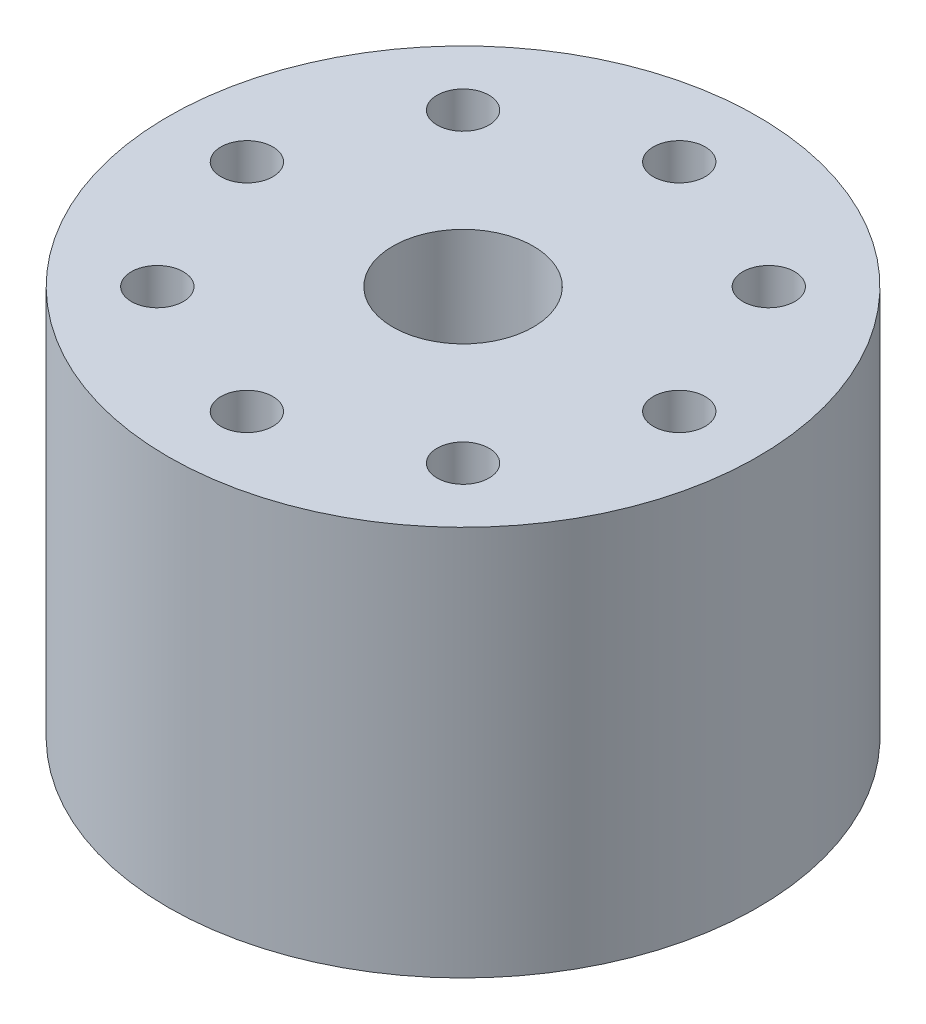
ISO-10303-21;
HEADER;
FILE_DESCRIPTION(('STEP AP214'),'2;1');
FILE_NAME('part.step','',(''),(''),'','','');
FILE_SCHEMA(('AUTOMOTIVE_DESIGN { 1 0 10303 214 1 1 1 1 }'));
ENDSEC;
DATA;
#1=APPLICATION_CONTEXT('core data for automotive mechanical design processes');
#2=APPLICATION_PROTOCOL_DEFINITION('international standard','automotive_design',2000,#1);
#3=PRODUCT_CONTEXT('',#1,'mechanical');
#4=PRODUCT('Part','Part','',(#3));
#5=PRODUCT_RELATED_PRODUCT_CATEGORY('part','',(#4));
#6=PRODUCT_DEFINITION_FORMATION('','',#4);
#7=PRODUCT_DEFINITION_CONTEXT('part definition',#1,'design');
#8=PRODUCT_DEFINITION('design','',#6,#7);
#9=PRODUCT_DEFINITION_SHAPE('','',#8);
#10=(LENGTH_UNIT() NAMED_UNIT(*) SI_UNIT(.MILLI.,.METRE.));
#11=(NAMED_UNIT(*) PLANE_ANGLE_UNIT() SI_UNIT($,.RADIAN.));
#12=(NAMED_UNIT(*) SI_UNIT($,.STERADIAN.) SOLID_ANGLE_UNIT());
#13=UNCERTAINTY_MEASURE_WITH_UNIT(LENGTH_MEASURE(1.E-05),#10,'distance_accuracy_value','');
#14=(GEOMETRIC_REPRESENTATION_CONTEXT(3) GLOBAL_UNCERTAINTY_ASSIGNED_CONTEXT((#13)) GLOBAL_UNIT_ASSIGNED_CONTEXT((#10,
#11,#12)) REPRESENTATION_CONTEXT('',''));
#15=CARTESIAN_POINT('',(0.,0.,0.));
#16=DIRECTION('',(0.,0.,1.));
#17=DIRECTION('',(1.,0.,0.));
#18=AXIS2_PLACEMENT_3D('',#15,#16,#17);
#19=CARTESIAN_POINT('',(0.,49.65,0.));
#20=DIRECTION('',(0.,-1.,0.));
#21=DIRECTION('',(0.,0.,-1.));
#22=AXIS2_PLACEMENT_3D('',#19,#20,#21);
#23=CYLINDRICAL_SURFACE('',#22,37.5);
#24=CARTESIAN_POINT('',(0.,49.65,0.));
#25=DIRECTION('',(0.,1.,0.));
#26=DIRECTION('',(0.,0.,1.));
#27=AXIS2_PLACEMENT_3D('',#24,#25,#26);
#28=CIRCLE('',#27,37.5);
#29=CARTESIAN_POINT('',(0.,49.65,37.5));
#30=VERTEX_POINT('',#29);
#31=EDGE_CURVE('E54',#30,#30,#28,.T.);
#32=ORIENTED_EDGE('',*,*,#31,.F.);
#33=EDGE_LOOP('',(#32));
#34=FACE_BOUND('',#33,.T.);
#35=CARTESIAN_POINT('',(0.,0.,0.));
#36=DIRECTION('',(0.,1.,0.));
#37=DIRECTION('',(0.,0.,1.));
#38=AXIS2_PLACEMENT_3D('',#35,#36,#37);
#39=CIRCLE('',#38,37.5);
#40=CARTESIAN_POINT('',(0.,0.,37.5));
#41=VERTEX_POINT('',#40);
#42=EDGE_CURVE('E58',#41,#41,#39,.T.);
#43=ORIENTED_EDGE('',*,*,#42,.T.);
#44=EDGE_LOOP('',(#43));
#45=FACE_BOUND('',#44,.T.);
#46=ADVANCED_FACE('F43',(#34,#45),#23,.T.);
#47=CARTESIAN_POINT('',(0.,49.65,0.));
#48=DIRECTION('',(0.,1.,0.));
#49=DIRECTION('',(0.,0.,1.));
#50=AXIS2_PLACEMENT_3D('',#47,#48,#49);
#51=PLANE('',#50);
#52=CARTESIAN_POINT('',(0.,49.65,27.5));
#53=DIRECTION('',(0.,1.,0.));
#54=DIRECTION('',(0.,0.,1.));
#55=AXIS2_PLACEMENT_3D('',#52,#53,#54);
#56=CIRCLE('',#55,3.3);
#57=CARTESIAN_POINT('',(0.,49.65,30.8));
#58=VERTEX_POINT('',#57);
#59=EDGE_CURVE('E273',#58,#58,#56,.T.);
#60=ORIENTED_EDGE('',*,*,#59,.F.);
#61=EDGE_LOOP('',(#60));
#62=FACE_BOUND('',#61,.T.);
#63=CARTESIAN_POINT('',(-19.4454364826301,49.65,19.44543648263));
#64=DIRECTION('',(0.,1.,0.));
#65=DIRECTION('',(0.,0.,1.));
#66=AXIS2_PLACEMENT_3D('',#63,#64,#65);
#67=CIRCLE('',#66,3.3);
#68=CARTESIAN_POINT('',(-19.4454364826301,49.65,22.74543648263));
#69=VERTEX_POINT('',#68);
#70=EDGE_CURVE('E279',#69,#69,#67,.T.);
#71=ORIENTED_EDGE('',*,*,#70,.F.);
#72=EDGE_LOOP('',(#71));
#73=FACE_BOUND('',#72,.T.);
#74=CARTESIAN_POINT('',(-27.5,49.65,0.));
#75=DIRECTION('',(0.,1.,0.));
#76=DIRECTION('',(0.,0.,1.));
#77=AXIS2_PLACEMENT_3D('',#74,#75,#76);
#78=CIRCLE('',#77,3.3);
#79=CARTESIAN_POINT('',(-27.5,49.65,3.2999999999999));
#80=VERTEX_POINT('',#79);
#81=EDGE_CURVE('E290',#80,#80,#78,.T.);
#82=ORIENTED_EDGE('',*,*,#81,.F.);
#83=EDGE_LOOP('',(#82));
#84=FACE_BOUND('',#83,.T.);
#85=CARTESIAN_POINT('',(-19.44543648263,49.65,-19.4454364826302));
#86=DIRECTION('',(0.,1.,0.));
#87=DIRECTION('',(0.,0.,1.));
#88=AXIS2_PLACEMENT_3D('',#85,#86,#87);
#89=CIRCLE('',#88,3.3);
#90=CARTESIAN_POINT('',(-19.44543648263,49.65,-16.1454364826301));
#91=VERTEX_POINT('',#90);
#92=EDGE_CURVE('E296',#91,#91,#89,.T.);
#93=ORIENTED_EDGE('',*,*,#92,.F.);
#94=EDGE_LOOP('',(#93));
#95=FACE_BOUND('',#94,.T.);
#96=CARTESIAN_POINT('',(1.92031473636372E-13,49.65,-27.5));
#97=DIRECTION('',(0.,1.,0.));
#98=DIRECTION('',(0.,0.,1.));
#99=AXIS2_PLACEMENT_3D('',#96,#97,#98);
#100=CIRCLE('',#99,3.3);
#101=CARTESIAN_POINT('',(1.92031473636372E-13,49.65,-24.2));
#102=VERTEX_POINT('',#101);
#103=EDGE_CURVE('E302',#102,#102,#100,.T.);
#104=ORIENTED_EDGE('',*,*,#103,.F.);
#105=EDGE_LOOP('',(#104));
#106=FACE_BOUND('',#105,.T.);
#107=CARTESIAN_POINT('',(19.4454364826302,49.65,-19.4454364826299));
#108=DIRECTION('',(0.,1.,0.));
#109=DIRECTION('',(0.,0.,1.));
#110=AXIS2_PLACEMENT_3D('',#107,#108,#109);
#111=CIRCLE('',#110,3.3);
#112=CARTESIAN_POINT('',(19.4454364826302,49.65,-16.1454364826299));
#113=VERTEX_POINT('',#112);
#114=EDGE_CURVE('E331',#113,#113,#111,.T.);
#115=ORIENTED_EDGE('',*,*,#114,.F.);
#116=EDGE_LOOP('',(#115));
#117=FACE_BOUND('',#116,.T.);
#118=CARTESIAN_POINT('',(27.5,49.65,2.88047210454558E-13));
#119=DIRECTION('',(0.,1.,0.));
#120=DIRECTION('',(0.,0.,1.));
#121=AXIS2_PLACEMENT_3D('',#118,#119,#120);
#122=CIRCLE('',#121,3.3);
#123=CARTESIAN_POINT('',(27.5,49.65,3.30000000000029));
#124=VERTEX_POINT('',#123);
#125=EDGE_CURVE('E338',#124,#124,#122,.T.);
#126=ORIENTED_EDGE('',*,*,#125,.F.);
#127=EDGE_LOOP('',(#126));
#128=FACE_BOUND('',#127,.T.);
#129=CARTESIAN_POINT('',(19.4454364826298,49.65,19.4454364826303));
#130=DIRECTION('',(0.,1.,0.));
#131=DIRECTION('',(0.,0.,1.));
#132=AXIS2_PLACEMENT_3D('',#129,#130,#131);
#133=CIRCLE('',#132,3.3);
#134=CARTESIAN_POINT('',(19.4454364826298,49.65,22.7454364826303));
#135=VERTEX_POINT('',#134);
#136=EDGE_CURVE('E274',#135,#135,#133,.T.);
#137=ORIENTED_EDGE('',*,*,#136,.F.);
#138=EDGE_LOOP('',(#137));
#139=FACE_BOUND('',#138,.T.);
#140=CARTESIAN_POINT('',(0.,49.65,0.));
#141=DIRECTION('',(0.,1.,0.));
#142=DIRECTION('',(0.,0.,1.));
#143=AXIS2_PLACEMENT_3D('',#140,#141,#142);
#144=CIRCLE('',#143,8.93);
#145=CARTESIAN_POINT('',(0.,49.65,8.93));
#146=VERTEX_POINT('',#145);
#147=EDGE_CURVE('E62',#146,#146,#144,.T.);
#148=ORIENTED_EDGE('',*,*,#147,.F.);
#149=EDGE_LOOP('',(#148));
#150=FACE_BOUND('',#149,.T.);
#151=ORIENTED_EDGE('',*,*,#31,.T.);
#152=EDGE_LOOP('',(#151));
#153=FACE_BOUND('',#152,.T.);
#154=ADVANCED_FACE('F104',(#62,#73,#84,#95,#106,#117,#128,#139,#150,#153),#51,.T.);
#155=CARTESIAN_POINT('',(0.,0.,0.));
#156=DIRECTION('',(0.,1.,0.));
#157=DIRECTION('',(0.,0.,1.));
#158=AXIS2_PLACEMENT_3D('',#155,#156,#157);
#159=PLANE('',#158);
#160=CARTESIAN_POINT('',(0.,0.,27.5));
#161=DIRECTION('',(0.,1.,0.));
#162=DIRECTION('',(0.,0.,1.));
#163=AXIS2_PLACEMENT_3D('',#160,#161,#162);
#164=CIRCLE('',#163,3.3);
#165=CARTESIAN_POINT('',(0.,0.,30.8));
#166=VERTEX_POINT('',#165);
#167=EDGE_CURVE('E270',#166,#166,#164,.T.);
#168=ORIENTED_EDGE('',*,*,#167,.T.);
#169=EDGE_LOOP('',(#168));
#170=FACE_BOUND('',#169,.T.);
#171=CARTESIAN_POINT('',(-19.4454364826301,0.,19.44543648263));
#172=DIRECTION('',(0.,1.,0.));
#173=DIRECTION('',(0.,0.,1.));
#174=AXIS2_PLACEMENT_3D('',#171,#172,#173);
#175=CIRCLE('',#174,3.3);
#176=CARTESIAN_POINT('',(-19.4454364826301,0.,22.74543648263));
#177=VERTEX_POINT('',#176);
#178=EDGE_CURVE('E287',#177,#177,#175,.T.);
#179=ORIENTED_EDGE('',*,*,#178,.T.);
#180=EDGE_LOOP('',(#179));
#181=FACE_BOUND('',#180,.T.);
#182=CARTESIAN_POINT('',(-27.5,0.,0.));
#183=DIRECTION('',(0.,1.,0.));
#184=DIRECTION('',(0.,0.,1.));
#185=AXIS2_PLACEMENT_3D('',#182,#183,#184);
#186=CIRCLE('',#185,3.3);
#187=CARTESIAN_POINT('',(-27.5,0.,3.2999999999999));
#188=VERTEX_POINT('',#187);
#189=EDGE_CURVE('E293',#188,#188,#186,.T.);
#190=ORIENTED_EDGE('',*,*,#189,.T.);
#191=EDGE_LOOP('',(#190));
#192=FACE_BOUND('',#191,.T.);
#193=CARTESIAN_POINT('',(-19.44543648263,0.,-19.4454364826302));
#194=DIRECTION('',(0.,1.,0.));
#195=DIRECTION('',(0.,0.,1.));
#196=AXIS2_PLACEMENT_3D('',#193,#194,#195);
#197=CIRCLE('',#196,3.3);
#198=CARTESIAN_POINT('',(-19.44543648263,0.,-16.1454364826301));
#199=VERTEX_POINT('',#198);
#200=EDGE_CURVE('E299',#199,#199,#197,.T.);
#201=ORIENTED_EDGE('',*,*,#200,.T.);
#202=EDGE_LOOP('',(#201));
#203=FACE_BOUND('',#202,.T.);
#204=CARTESIAN_POINT('',(1.92031473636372E-13,0.,-27.5));
#205=DIRECTION('',(0.,1.,0.));
#206=DIRECTION('',(0.,0.,1.));
#207=AXIS2_PLACEMENT_3D('',#204,#205,#206);
#208=CIRCLE('',#207,3.3);
#209=CARTESIAN_POINT('',(1.92031473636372E-13,0.,-24.2));
#210=VERTEX_POINT('',#209);
#211=EDGE_CURVE('E326',#210,#210,#208,.T.);
#212=ORIENTED_EDGE('',*,*,#211,.T.);
#213=EDGE_LOOP('',(#212));
#214=FACE_BOUND('',#213,.T.);
#215=CARTESIAN_POINT('',(19.4454364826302,0.,-19.4454364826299));
#216=DIRECTION('',(0.,1.,0.));
#217=DIRECTION('',(0.,0.,1.));
#218=AXIS2_PLACEMENT_3D('',#215,#216,#217);
#219=CIRCLE('',#218,3.3);
#220=CARTESIAN_POINT('',(19.4454364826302,0.,-16.1454364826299));
#221=VERTEX_POINT('',#220);
#222=EDGE_CURVE('E336',#221,#221,#219,.T.);
#223=ORIENTED_EDGE('',*,*,#222,.T.);
#224=EDGE_LOOP('',(#223));
#225=FACE_BOUND('',#224,.T.);
#226=CARTESIAN_POINT('',(27.5,0.,2.88047210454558E-13));
#227=DIRECTION('',(0.,1.,0.));
#228=DIRECTION('',(0.,0.,1.));
#229=AXIS2_PLACEMENT_3D('',#226,#227,#228);
#230=CIRCLE('',#229,3.3);
#231=CARTESIAN_POINT('',(27.5,0.,3.30000000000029));
#232=VERTEX_POINT('',#231);
#233=EDGE_CURVE('E282',#232,#232,#230,.T.);
#234=ORIENTED_EDGE('',*,*,#233,.T.);
#235=EDGE_LOOP('',(#234));
#236=FACE_BOUND('',#235,.T.);
#237=CARTESIAN_POINT('',(19.4454364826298,0.,19.4454364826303));
#238=DIRECTION('',(0.,1.,0.));
#239=DIRECTION('',(0.,0.,1.));
#240=AXIS2_PLACEMENT_3D('',#237,#238,#239);
#241=CIRCLE('',#240,3.3);
#242=CARTESIAN_POINT('',(19.4454364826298,0.,22.7454364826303));
#243=VERTEX_POINT('',#242);
#244=EDGE_CURVE('E277',#243,#243,#241,.T.);
#245=ORIENTED_EDGE('',*,*,#244,.T.);
#246=EDGE_LOOP('',(#245));
#247=FACE_BOUND('',#246,.T.);
#248=CARTESIAN_POINT('',(0.,0.,0.));
#249=DIRECTION('',(0.,-1.,0.));
#250=DIRECTION('',(0.,0.,-1.));
#251=AXIS2_PLACEMENT_3D('',#248,#249,#250);
#252=CIRCLE('',#251,19.);
#253=CARTESIAN_POINT('',(0.,0.,-19.));
#254=VERTEX_POINT('',#253);
#255=EDGE_CURVE('E67',#254,#254,#252,.T.);
#256=ORIENTED_EDGE('',*,*,#255,.F.);
#257=EDGE_LOOP('',(#256));
#258=FACE_BOUND('',#257,.T.);
#259=ORIENTED_EDGE('',*,*,#42,.F.);
#260=EDGE_LOOP('',(#259));
#261=FACE_BOUND('',#260,.T.);
#262=ADVANCED_FACE('F103',(#170,#181,#192,#203,#214,#225,#236,#247,#258,#261),#159,.F.);
#263=CARTESIAN_POINT('',(0.,26.65,0.));
#264=DIRECTION('',(0.,1.,0.));
#265=DIRECTION('',(0.,0.,1.));
#266=AXIS2_PLACEMENT_3D('',#263,#264,#265);
#267=CYLINDRICAL_SURFACE('',#266,8.93);
#268=CARTESIAN_POINT('',(0.,31.6845977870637,0.));
#269=DIRECTION('',(0.,1.,0.));
#270=DIRECTION('',(0.,0.,1.));
#271=AXIS2_PLACEMENT_3D('',#268,#269,#270);
#272=CIRCLE('',#271,8.93);
#273=CARTESIAN_POINT('',(0.,31.6845977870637,8.93));
#274=VERTEX_POINT('',#273);
#275=EDGE_CURVE('E11',#274,#274,#272,.F.);
#276=ORIENTED_EDGE('',*,*,#275,.T.);
#277=EDGE_LOOP('',(#276));
#278=FACE_BOUND('',#277,.T.);
#279=ORIENTED_EDGE('',*,*,#147,.T.);
#280=EDGE_LOOP('',(#279));
#281=FACE_BOUND('',#280,.T.);
#282=ADVANCED_FACE('F96',(#278,#281),#267,.F.);
#283=CARTESIAN_POINT('',(0.,3.15,0.));
#284=DIRECTION('',(0.,-1.,0.));
#285=DIRECTION('',(0.,0.,-1.));
#286=AXIS2_PLACEMENT_3D('',#283,#284,#285);
#287=PLANE('',#286);
#288=CARTESIAN_POINT('',(0.,3.15,0.));
#289=DIRECTION('',(0.,-1.,0.));
#290=DIRECTION('',(0.,0.,-1.));
#291=AXIS2_PLACEMENT_3D('',#288,#289,#290);
#292=CIRCLE('',#291,19.);
#293=CARTESIAN_POINT('',(0.,3.15,-19.));
#294=VERTEX_POINT('',#293);
#295=EDGE_CURVE('E66',#294,#294,#292,.T.);
#296=ORIENTED_EDGE('',*,*,#295,.T.);
#297=EDGE_LOOP('',(#296));
#298=FACE_BOUND('',#297,.T.);
#299=CARTESIAN_POINT('',(0.,3.15,0.));
#300=DIRECTION('',(0.,-1.,0.));
#301=DIRECTION('',(0.,0.,-1.));
#302=AXIS2_PLACEMENT_3D('',#299,#300,#301);
#303=CIRCLE('',#302,15.);
#304=CARTESIAN_POINT('',(0.,3.15,-15.));
#305=VERTEX_POINT('',#304);
#306=EDGE_CURVE('E70',#305,#305,#303,.T.);
#307=ORIENTED_EDGE('',*,*,#306,.F.);
#308=EDGE_LOOP('',(#307));
#309=FACE_BOUND('',#308,.T.);
#310=ADVANCED_FACE('F93',(#298,#309),#287,.T.);
#311=CARTESIAN_POINT('',(0.,3.15,0.));
#312=DIRECTION('',(0.,-1.,0.));
#313=DIRECTION('',(0.,0.,-1.));
#314=AXIS2_PLACEMENT_3D('',#311,#312,#313);
#315=CYLINDRICAL_SURFACE('',#314,19.);
#316=ORIENTED_EDGE('',*,*,#295,.F.);
#317=EDGE_LOOP('',(#316));
#318=FACE_BOUND('',#317,.T.);
#319=ORIENTED_EDGE('',*,*,#255,.T.);
#320=EDGE_LOOP('',(#319));
#321=FACE_BOUND('',#320,.T.);
#322=ADVANCED_FACE('F90',(#318,#321),#315,.F.);
#323=CARTESIAN_POINT('',(-15.,24.45,0.));
#324=CARTESIAN_POINT('',(-24.,13.8,0.));
#325=CARTESIAN_POINT('',(-15.,3.15,0.));
#326=B_SPLINE_CURVE_WITH_KNOTS('',2,(#323,#324,#325),.UNSPECIFIED.,.F.,.F.,(3,3),(0.,1.),.UNSPECIFIED.);
#327=CARTESIAN_POINT('',(0.,3.15,0.));
#328=DIRECTION('',(0.,-1.,0.));
#329=AXIS1_PLACEMENT('',#327,#328);
#330=SURFACE_OF_REVOLUTION('',#326,#329);
#331=ORIENTED_EDGE('',*,*,#306,.T.);
#332=EDGE_LOOP('',(#331));
#333=FACE_BOUND('',#332,.T.);
#334=CARTESIAN_POINT('',(0.,24.45,0.));
#335=DIRECTION('',(0.,1.,0.));
#336=DIRECTION('',(-1.,0.,0.));
#337=AXIS2_PLACEMENT_3D('',#334,#335,#336);
#338=CIRCLE('',#337,15.);
#339=CARTESIAN_POINT('',(-15.,24.45,0.));
#340=VERTEX_POINT('',#339);
#341=EDGE_CURVE('E75',#340,#340,#338,.T.);
#342=ORIENTED_EDGE('',*,*,#341,.T.);
#343=EDGE_LOOP('',(#342));
#344=FACE_BOUND('',#343,.T.);
#345=ADVANCED_FACE('F85',(#333,#344),#330,.F.);
#346=CARTESIAN_POINT('',(-15.,26.65,0.));
#347=DIRECTION('',(0.,1.,0.));
#348=DIRECTION('',(-1.,0.,0.));
#349=AXIS2_PLACEMENT_3D('',#346,#347,#348);
#350=PLANE('',#349);
#351=CARTESIAN_POINT('',(0.,26.65,0.));
#352=DIRECTION('',(0.,1.,0.));
#353=DIRECTION('',(-1.,0.,0.));
#354=AXIS2_PLACEMENT_3D('',#351,#352,#353);
#355=CIRCLE('',#354,14.93);
#356=CARTESIAN_POINT('',(-14.93,26.65,0.));
#357=VERTEX_POINT('',#356);
#358=EDGE_CURVE('E50',#357,#357,#355,.T.);
#359=ORIENTED_EDGE('',*,*,#358,.T.);
#360=EDGE_LOOP('',(#359));
#361=FACE_BOUND('',#360,.T.);
#362=CARTESIAN_POINT('',(0.,26.65,0.));
#363=DIRECTION('',(0.,1.,0.));
#364=DIRECTION('',(-1.,0.,0.));
#365=AXIS2_PLACEMENT_3D('',#362,#363,#364);
#366=CIRCLE('',#365,15.);
#367=CARTESIAN_POINT('',(-15.,26.65,0.));
#368=VERTEX_POINT('',#367);
#369=EDGE_CURVE('E304',#368,#368,#366,.T.);
#370=ORIENTED_EDGE('',*,*,#369,.F.);
#371=EDGE_LOOP('',(#370));
#372=FACE_BOUND('',#371,.T.);
#373=ADVANCED_FACE('F89',(#361,#372),#350,.F.);
#374=CARTESIAN_POINT('',(0.,26.65,0.));
#375=DIRECTION('',(0.,1.,0.));
#376=DIRECTION('',(-1.,0.,0.));
#377=AXIS2_PLACEMENT_3D('',#374,#375,#376);
#378=CYLINDRICAL_SURFACE('',#377,15.);
#379=ORIENTED_EDGE('',*,*,#341,.F.);
#380=EDGE_LOOP('',(#379));
#381=FACE_BOUND('',#380,.T.);
#382=ORIENTED_EDGE('',*,*,#369,.T.);
#383=EDGE_LOOP('',(#382));
#384=FACE_BOUND('',#383,.T.);
#385=ADVANCED_FACE('F152',(#381,#384),#378,.F.);
#386=CARTESIAN_POINT('',(19.4454364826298,0.,19.4454364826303));
#387=DIRECTION('',(0.,1.,0.));
#388=DIRECTION('',(0.,0.,1.));
#389=AXIS2_PLACEMENT_3D('',#386,#387,#388);
#390=CYLINDRICAL_SURFACE('',#389,3.3);
#391=ORIENTED_EDGE('',*,*,#244,.F.);
#392=EDGE_LOOP('',(#391));
#393=FACE_BOUND('',#392,.T.);
#394=ORIENTED_EDGE('',*,*,#136,.T.);
#395=EDGE_LOOP('',(#394));
#396=FACE_BOUND('',#395,.T.);
#397=ADVANCED_FACE('F158',(#393,#396),#390,.F.);
#398=CARTESIAN_POINT('',(27.5,0.,2.88047210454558E-13));
#399=DIRECTION('',(0.,1.,0.));
#400=DIRECTION('',(0.,0.,1.));
#401=AXIS2_PLACEMENT_3D('',#398,#399,#400);
#402=CYLINDRICAL_SURFACE('',#401,3.3);
#403=ORIENTED_EDGE('',*,*,#125,.T.);
#404=EDGE_LOOP('',(#403));
#405=FACE_BOUND('',#404,.T.);
#406=ORIENTED_EDGE('',*,*,#233,.F.);
#407=EDGE_LOOP('',(#406));
#408=FACE_BOUND('',#407,.T.);
#409=ADVANCED_FACE('F164',(#405,#408),#402,.F.);
#410=CARTESIAN_POINT('',(19.4454364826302,0.,-19.4454364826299));
#411=DIRECTION('',(0.,1.,0.));
#412=DIRECTION('',(0.,0.,1.));
#413=AXIS2_PLACEMENT_3D('',#410,#411,#412);
#414=CYLINDRICAL_SURFACE('',#413,3.3);
#415=ORIENTED_EDGE('',*,*,#222,.F.);
#416=EDGE_LOOP('',(#415));
#417=FACE_BOUND('',#416,.T.);
#418=ORIENTED_EDGE('',*,*,#114,.T.);
#419=EDGE_LOOP('',(#418));
#420=FACE_BOUND('',#419,.T.);
#421=ADVANCED_FACE('F172',(#417,#420),#414,.F.);
#422=CARTESIAN_POINT('',(1.92031473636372E-13,0.,-27.5));
#423=DIRECTION('',(0.,1.,0.));
#424=DIRECTION('',(0.,0.,1.));
#425=AXIS2_PLACEMENT_3D('',#422,#423,#424);
#426=CYLINDRICAL_SURFACE('',#425,3.3);
#427=ORIENTED_EDGE('',*,*,#211,.F.);
#428=EDGE_LOOP('',(#427));
#429=FACE_BOUND('',#428,.T.);
#430=ORIENTED_EDGE('',*,*,#103,.T.);
#431=EDGE_LOOP('',(#430));
#432=FACE_BOUND('',#431,.T.);
#433=ADVANCED_FACE('F180',(#429,#432),#426,.F.);
#434=CARTESIAN_POINT('',(-19.44543648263,0.,-19.4454364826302));
#435=DIRECTION('',(0.,1.,0.));
#436=DIRECTION('',(0.,0.,1.));
#437=AXIS2_PLACEMENT_3D('',#434,#435,#436);
#438=CYLINDRICAL_SURFACE('',#437,3.3);
#439=ORIENTED_EDGE('',*,*,#200,.F.);
#440=EDGE_LOOP('',(#439));
#441=FACE_BOUND('',#440,.T.);
#442=ORIENTED_EDGE('',*,*,#92,.T.);
#443=EDGE_LOOP('',(#442));
#444=FACE_BOUND('',#443,.T.);
#445=ADVANCED_FACE('F188',(#441,#444),#438,.F.);
#446=CARTESIAN_POINT('',(-27.5,0.,0.));
#447=DIRECTION('',(0.,1.,0.));
#448=DIRECTION('',(0.,0.,1.));
#449=AXIS2_PLACEMENT_3D('',#446,#447,#448);
#450=CYLINDRICAL_SURFACE('',#449,3.3);
#451=ORIENTED_EDGE('',*,*,#189,.F.);
#452=EDGE_LOOP('',(#451));
#453=FACE_BOUND('',#452,.T.);
#454=ORIENTED_EDGE('',*,*,#81,.T.);
#455=EDGE_LOOP('',(#454));
#456=FACE_BOUND('',#455,.T.);
#457=ADVANCED_FACE('F196',(#453,#456),#450,.F.);
#458=CARTESIAN_POINT('',(-19.4454364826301,0.,19.44543648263));
#459=DIRECTION('',(0.,1.,0.));
#460=DIRECTION('',(0.,0.,1.));
#461=AXIS2_PLACEMENT_3D('',#458,#459,#460);
#462=CYLINDRICAL_SURFACE('',#461,3.3);
#463=ORIENTED_EDGE('',*,*,#178,.F.);
#464=EDGE_LOOP('',(#463));
#465=FACE_BOUND('',#464,.T.);
#466=ORIENTED_EDGE('',*,*,#70,.T.);
#467=EDGE_LOOP('',(#466));
#468=FACE_BOUND('',#467,.T.);
#469=ADVANCED_FACE('F204',(#465,#468),#462,.F.);
#470=CARTESIAN_POINT('',(0.,0.,27.5));
#471=DIRECTION('',(0.,1.,0.));
#472=DIRECTION('',(0.,0.,1.));
#473=AXIS2_PLACEMENT_3D('',#470,#471,#472);
#474=CYLINDRICAL_SURFACE('',#473,3.3);
#475=ORIENTED_EDGE('',*,*,#167,.F.);
#476=EDGE_LOOP('',(#475));
#477=FACE_BOUND('',#476,.T.);
#478=ORIENTED_EDGE('',*,*,#59,.T.);
#479=EDGE_LOOP('',(#478));
#480=FACE_BOUND('',#479,.T.);
#481=ADVANCED_FACE('F212',(#477,#480),#474,.F.);
#482=CARTESIAN_POINT('',(0.,26.65,0.));
#483=DIRECTION('',(0.,-1.,0.));
#484=DIRECTION('',(0.,0.,-1.));
#485=AXIS2_PLACEMENT_3D('',#482,#483,#484);
#486=CONICAL_SURFACE('',#485,14.93,0.872664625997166);
#487=ORIENTED_EDGE('',*,*,#275,.F.);
#488=EDGE_LOOP('',(#487));
#489=FACE_BOUND('',#488,.T.);
#490=ORIENTED_EDGE('',*,*,#358,.F.);
#491=EDGE_LOOP('',(#490));
#492=FACE_BOUND('',#491,.T.);
#493=ADVANCED_FACE('F45',(#489,#492),#486,.F.);
#494=CLOSED_SHELL('',(#46,#154,#262,#282,#310,#322,#345,#373,#385,#397,#409,#421,#433,#445,#457,
#469,#481,#493));
#495=MANIFOLD_SOLID_BREP('B2',#494);
#496=ADVANCED_BREP_SHAPE_REPRESENTATION('',(#18,#495),#14);
#497=SHAPE_DEFINITION_REPRESENTATION(#9,#496);
ENDSEC;
END-ISO-10303-21;
